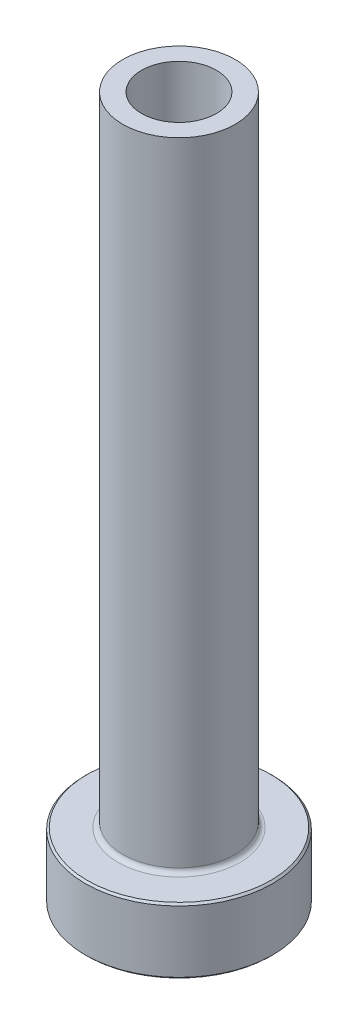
ISO-10303-21;
HEADER;
FILE_DESCRIPTION(('STEP AP214'),'2;1');
FILE_NAME('part.step','',(''),(''),'','','');
FILE_SCHEMA(('AUTOMOTIVE_DESIGN { 1 0 10303 214 1 1 1 1 }'));
ENDSEC;
DATA;
#1=APPLICATION_CONTEXT('core data for automotive mechanical design processes');
#2=APPLICATION_PROTOCOL_DEFINITION('international standard','automotive_design',2000,#1);
#3=PRODUCT_CONTEXT('',#1,'mechanical');
#4=PRODUCT('Part','Part','',(#3));
#5=PRODUCT_RELATED_PRODUCT_CATEGORY('part','',(#4));
#6=PRODUCT_DEFINITION_FORMATION('','',#4);
#7=PRODUCT_DEFINITION_CONTEXT('part definition',#1,'design');
#8=PRODUCT_DEFINITION('design','',#6,#7);
#9=PRODUCT_DEFINITION_SHAPE('','',#8);
#10=(LENGTH_UNIT() NAMED_UNIT(*) SI_UNIT(.MILLI.,.METRE.));
#11=(NAMED_UNIT(*) PLANE_ANGLE_UNIT() SI_UNIT($,.RADIAN.));
#12=(NAMED_UNIT(*) SI_UNIT($,.STERADIAN.) SOLID_ANGLE_UNIT());
#13=UNCERTAINTY_MEASURE_WITH_UNIT(LENGTH_MEASURE(1.E-05),#10,'distance_accuracy_value','');
#14=(GEOMETRIC_REPRESENTATION_CONTEXT(3) GLOBAL_UNCERTAINTY_ASSIGNED_CONTEXT((#13)) GLOBAL_UNIT_ASSIGNED_CONTEXT((#10,
#11,#12)) REPRESENTATION_CONTEXT('',''));
#15=CARTESIAN_POINT('',(0.,0.,0.));
#16=DIRECTION('',(0.,0.,1.));
#17=DIRECTION('',(1.,0.,0.));
#18=AXIS2_PLACEMENT_3D('',#15,#16,#17);
#19=CARTESIAN_POINT('',(0.,92.1876809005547,0.));
#20=DIRECTION('',(0.,1.,0.));
#21=DIRECTION('',(0.,0.,1.));
#22=AXIS2_PLACEMENT_3D('',#19,#20,#21);
#23=CYLINDRICAL_SURFACE('',#22,4.00000000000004);
#24=CARTESIAN_POINT('',(0.,75.,0.));
#25=DIRECTION('',(0.,1.,0.));
#26=DIRECTION('',(0.,0.,1.));
#27=AXIS2_PLACEMENT_3D('',#24,#25,#26);
#28=CIRCLE('',#27,4.00000000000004);
#29=CARTESIAN_POINT('',(0.,75.,4.00000000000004));
#30=VERTEX_POINT('',#29);
#31=EDGE_CURVE('E62',#30,#30,#28,.T.);
#32=ORIENTED_EDGE('',*,*,#31,.T.);
#33=EDGE_LOOP('',(#32));
#34=FACE_BOUND('',#33,.T.);
#35=CARTESIAN_POINT('',(0.,30.,0.));
#36=DIRECTION('',(0.,1.,0.));
#37=DIRECTION('',(0.,0.,1.));
#38=AXIS2_PLACEMENT_3D('',#35,#36,#37);
#39=CIRCLE('',#38,4.00000000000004);
#40=CARTESIAN_POINT('',(0.,30.,4.00000000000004));
#41=VERTEX_POINT('',#40);
#42=EDGE_CURVE('E71',#41,#41,#39,.T.);
#43=ORIENTED_EDGE('',*,*,#42,.F.);
#44=EDGE_LOOP('',(#43));
#45=FACE_BOUND('',#44,.T.);
#46=ADVANCED_FACE('F30',(#34,#45),#23,.F.);
#47=CARTESIAN_POINT('',(-4.00000000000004,75.,0.));
#48=DIRECTION('',(0.,1.,0.));
#49=DIRECTION('',(0.,0.,1.));
#50=AXIS2_PLACEMENT_3D('',#47,#48,#49);
#51=PLANE('',#50);
#52=CARTESIAN_POINT('',(0.,75.,0.));
#53=DIRECTION('',(0.,1.,0.));
#54=DIRECTION('',(0.,0.,1.));
#55=AXIS2_PLACEMENT_3D('',#52,#53,#54);
#56=CIRCLE('',#55,6.);
#57=CARTESIAN_POINT('',(0.,75.,6.));
#58=VERTEX_POINT('',#57);
#59=EDGE_CURVE('E65',#58,#58,#56,.T.);
#60=ORIENTED_EDGE('',*,*,#59,.T.);
#61=EDGE_LOOP('',(#60));
#62=FACE_BOUND('',#61,.T.);
#63=ORIENTED_EDGE('',*,*,#31,.F.);
#64=EDGE_LOOP('',(#63));
#65=FACE_BOUND('',#64,.T.);
#66=ADVANCED_FACE('F79',(#62,#65),#51,.T.);
#67=CARTESIAN_POINT('',(0.,92.1876809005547,0.));
#68=DIRECTION('',(0.,1.,0.));
#69=DIRECTION('',(0.,0.,1.));
#70=AXIS2_PLACEMENT_3D('',#67,#68,#69);
#71=CYLINDRICAL_SURFACE('',#70,5.99999999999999);
#72=CARTESIAN_POINT('',(0.,7.50000000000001,0.));
#73=DIRECTION('',(0.,1.,0.));
#74=DIRECTION('',(0.,0.,1.));
#75=AXIS2_PLACEMENT_3D('',#72,#73,#74);
#76=CIRCLE('',#75,5.99999999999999);
#77=CARTESIAN_POINT('',(0.,7.50000000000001,5.99999999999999));
#78=VERTEX_POINT('',#77);
#79=EDGE_CURVE('E59',#78,#78,#76,.T.);
#80=ORIENTED_EDGE('',*,*,#79,.T.);
#81=EDGE_LOOP('',(#80));
#82=FACE_BOUND('',#81,.T.);
#83=ORIENTED_EDGE('',*,*,#59,.F.);
#84=EDGE_LOOP('',(#83));
#85=FACE_BOUND('',#84,.T.);
#86=ADVANCED_FACE('F85',(#82,#85),#71,.T.);
#87=CARTESIAN_POINT('',(-5.99999999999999,7.,0.));
#88=DIRECTION('',(0.,1.,0.));
#89=DIRECTION('',(0.,0.,1.));
#90=AXIS2_PLACEMENT_3D('',#87,#88,#89);
#91=PLANE('',#90);
#92=CARTESIAN_POINT('',(0.,7.,0.));
#93=DIRECTION('',(0.,1.,0.));
#94=DIRECTION('',(0.,0.,1.));
#95=AXIS2_PLACEMENT_3D('',#92,#93,#94);
#96=CIRCLE('',#95,9.8);
#97=CARTESIAN_POINT('',(0.,7.,9.8));
#98=VERTEX_POINT('',#97);
#99=EDGE_CURVE('E53',#98,#98,#96,.T.);
#100=ORIENTED_EDGE('',*,*,#99,.T.);
#101=EDGE_LOOP('',(#100));
#102=FACE_BOUND('',#101,.T.);
#103=CARTESIAN_POINT('',(0.,7.,0.));
#104=DIRECTION('',(0.,1.,0.));
#105=DIRECTION('',(0.,0.,1.));
#106=AXIS2_PLACEMENT_3D('',#103,#104,#105);
#107=CIRCLE('',#106,6.49999999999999);
#108=CARTESIAN_POINT('',(0.,7.,6.49999999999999));
#109=VERTEX_POINT('',#108);
#110=EDGE_CURVE('E56',#109,#109,#107,.F.);
#111=ORIENTED_EDGE('',*,*,#110,.T.);
#112=EDGE_LOOP('',(#111));
#113=FACE_BOUND('',#112,.T.);
#114=ADVANCED_FACE('F111',(#102,#113),#91,.T.);
#115=CARTESIAN_POINT('',(0.,92.1876809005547,0.));
#116=DIRECTION('',(0.,1.,0.));
#117=DIRECTION('',(0.,0.,1.));
#118=AXIS2_PLACEMENT_3D('',#115,#116,#117);
#119=CYLINDRICAL_SURFACE('',#118,9.99999999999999);
#120=CARTESIAN_POINT('',(0.,6.8,0.));
#121=DIRECTION('',(0.,1.,0.));
#122=DIRECTION('',(0.,0.,1.));
#123=AXIS2_PLACEMENT_3D('',#120,#121,#122);
#124=CIRCLE('',#123,9.99999999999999);
#125=CARTESIAN_POINT('',(0.,6.8,9.99999999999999));
#126=VERTEX_POINT('',#125);
#127=EDGE_CURVE('E45',#126,#126,#124,.F.);
#128=ORIENTED_EDGE('',*,*,#127,.T.);
#129=EDGE_LOOP('',(#128));
#130=FACE_BOUND('',#129,.T.);
#131=CARTESIAN_POINT('',(0.,0.200000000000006,0.));
#132=DIRECTION('',(0.,-1.,0.));
#133=DIRECTION('',(0.,0.,-1.));
#134=AXIS2_PLACEMENT_3D('',#131,#132,#133);
#135=CIRCLE('',#134,9.99999999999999);
#136=CARTESIAN_POINT('',(0.,0.200000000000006,-9.99999999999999));
#137=VERTEX_POINT('',#136);
#138=EDGE_CURVE('E50',#137,#137,#135,.F.);
#139=ORIENTED_EDGE('',*,*,#138,.T.);
#140=EDGE_LOOP('',(#139));
#141=FACE_BOUND('',#140,.T.);
#142=ADVANCED_FACE('F108',(#130,#141),#119,.T.);
#143=CARTESIAN_POINT('',(-9.99999999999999,0.,0.));
#144=DIRECTION('',(0.,-1.,0.));
#145=DIRECTION('',(0.,0.,-1.));
#146=AXIS2_PLACEMENT_3D('',#143,#144,#145);
#147=PLANE('',#146);
#148=CARTESIAN_POINT('',(0.,0.,0.));
#149=DIRECTION('',(0.,-1.,0.));
#150=DIRECTION('',(0.,0.,-1.));
#151=AXIS2_PLACEMENT_3D('',#148,#149,#150);
#152=CIRCLE('',#151,4.74999999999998);
#153=CARTESIAN_POINT('',(0.,0.,-4.74999999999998));
#154=VERTEX_POINT('',#153);
#155=EDGE_CURVE('E37',#154,#154,#152,.F.);
#156=ORIENTED_EDGE('',*,*,#155,.T.);
#157=EDGE_LOOP('',(#156));
#158=FACE_BOUND('',#157,.T.);
#159=CARTESIAN_POINT('',(0.,0.,0.));
#160=DIRECTION('',(0.,-1.,0.));
#161=DIRECTION('',(0.,0.,-1.));
#162=AXIS2_PLACEMENT_3D('',#159,#160,#161);
#163=CIRCLE('',#162,9.79999999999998);
#164=CARTESIAN_POINT('',(0.,0.,-9.79999999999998));
#165=VERTEX_POINT('',#164);
#166=EDGE_CURVE('E41',#165,#165,#163,.T.);
#167=ORIENTED_EDGE('',*,*,#166,.T.);
#168=EDGE_LOOP('',(#167));
#169=FACE_BOUND('',#168,.T.);
#170=ADVANCED_FACE('F110',(#158,#169),#147,.T.);
#171=CARTESIAN_POINT('',(0.,92.1876809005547,0.));
#172=DIRECTION('',(0.,1.,0.));
#173=DIRECTION('',(0.,0.,1.));
#174=AXIS2_PLACEMENT_3D('',#171,#172,#173);
#175=CYLINDRICAL_SURFACE('',#174,4.24999999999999);
#176=CARTESIAN_POINT('',(0.,0.5,0.));
#177=DIRECTION('',(0.,-1.,0.));
#178=DIRECTION('',(0.,0.,-1.));
#179=AXIS2_PLACEMENT_3D('',#176,#177,#178);
#180=CIRCLE('',#179,4.24999999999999);
#181=CARTESIAN_POINT('',(0.,0.5,-4.24999999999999));
#182=VERTEX_POINT('',#181);
#183=EDGE_CURVE('E10',#182,#182,#180,.T.);
#184=ORIENTED_EDGE('',*,*,#183,.T.);
#185=EDGE_LOOP('',(#184));
#186=FACE_BOUND('',#185,.T.);
#187=CARTESIAN_POINT('',(0.,18.,0.));
#188=DIRECTION('',(0.,1.,0.));
#189=DIRECTION('',(0.,0.,1.));
#190=AXIS2_PLACEMENT_3D('',#187,#188,#189);
#191=CIRCLE('',#190,4.24999999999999);
#192=CARTESIAN_POINT('',(0.,18.,4.24999999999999));
#193=VERTEX_POINT('',#192);
#194=EDGE_CURVE('E68',#193,#193,#191,.T.);
#195=ORIENTED_EDGE('',*,*,#194,.T.);
#196=EDGE_LOOP('',(#195));
#197=FACE_BOUND('',#196,.T.);
#198=ADVANCED_FACE('F118',(#186,#197),#175,.F.);
#199=CARTESIAN_POINT('',(0.,18.,0.));
#200=DIRECTION('',(0.,-1.,0.));
#201=DIRECTION('',(0.,0.,-1.));
#202=AXIS2_PLACEMENT_3D('',#199,#200,#201);
#203=CONICAL_SURFACE('',#202,4.24999999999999,0.0208303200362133);
#204=ORIENTED_EDGE('',*,*,#42,.T.);
#205=EDGE_LOOP('',(#204));
#206=FACE_BOUND('',#205,.T.);
#207=ORIENTED_EDGE('',*,*,#194,.F.);
#208=EDGE_LOOP('',(#207));
#209=FACE_BOUND('',#208,.T.);
#210=ADVANCED_FACE('F75',(#206,#209),#203,.F.);
#211=CARTESIAN_POINT('',(0.,7.50000000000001,0.));
#212=DIRECTION('',(0.,1.,0.));
#213=DIRECTION('',(0.,0.,1.));
#214=AXIS2_PLACEMENT_3D('',#211,#212,#213);
#215=TOROIDAL_SURFACE('',#214,6.49999999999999,0.5);
#216=ORIENTED_EDGE('',*,*,#110,.F.);
#217=EDGE_LOOP('',(#216));
#218=FACE_BOUND('',#217,.T.);
#219=ORIENTED_EDGE('',*,*,#79,.F.);
#220=EDGE_LOOP('',(#219));
#221=FACE_BOUND('',#220,.T.);
#222=ADVANCED_FACE('F90',(#218,#221),#215,.F.);
#223=CARTESIAN_POINT('',(0.,7.00000000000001,0.));
#224=DIRECTION('',(0.,-1.,0.));
#225=DIRECTION('',(0.,0.,-1.));
#226=AXIS2_PLACEMENT_3D('',#223,#224,#225);
#227=CONICAL_SURFACE('',#226,9.8,0.785398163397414);
#228=ORIENTED_EDGE('',*,*,#127,.F.);
#229=EDGE_LOOP('',(#228));
#230=FACE_BOUND('',#229,.T.);
#231=ORIENTED_EDGE('',*,*,#99,.F.);
#232=EDGE_LOOP('',(#231));
#233=FACE_BOUND('',#232,.T.);
#234=ADVANCED_FACE('F93',(#230,#233),#227,.T.);
#235=CARTESIAN_POINT('',(0.,0.200000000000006,0.));
#236=DIRECTION('',(0.,1.,0.));
#237=DIRECTION('',(0.,0.,1.));
#238=AXIS2_PLACEMENT_3D('',#235,#236,#237);
#239=CONICAL_SURFACE('',#238,9.99999999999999,0.785398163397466);
#240=ORIENTED_EDGE('',*,*,#166,.F.);
#241=EDGE_LOOP('',(#240));
#242=FACE_BOUND('',#241,.T.);
#243=ORIENTED_EDGE('',*,*,#138,.F.);
#244=EDGE_LOOP('',(#243));
#245=FACE_BOUND('',#244,.T.);
#246=ADVANCED_FACE('F96',(#242,#245),#239,.T.);
#247=CARTESIAN_POINT('',(0.,0.,0.));
#248=DIRECTION('',(0.,-1.,0.));
#249=DIRECTION('',(0.,0.,-1.));
#250=AXIS2_PLACEMENT_3D('',#247,#248,#249);
#251=CONICAL_SURFACE('',#250,4.74999999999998,0.78539816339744);
#252=ORIENTED_EDGE('',*,*,#183,.F.);
#253=EDGE_LOOP('',(#252));
#254=FACE_BOUND('',#253,.T.);
#255=ORIENTED_EDGE('',*,*,#155,.F.);
#256=EDGE_LOOP('',(#255));
#257=FACE_BOUND('',#256,.T.);
#258=ADVANCED_FACE('F32',(#254,#257),#251,.F.);
#259=CLOSED_SHELL('',(#46,#66,#86,#114,#142,#170,#198,#210,#222,#234,#246,#258));
#260=MANIFOLD_SOLID_BREP('B2',#259);
#261=ADVANCED_BREP_SHAPE_REPRESENTATION('',(#18,#260),#14);
#262=SHAPE_DEFINITION_REPRESENTATION(#9,#261);
ENDSEC;
END-ISO-10303-21;
